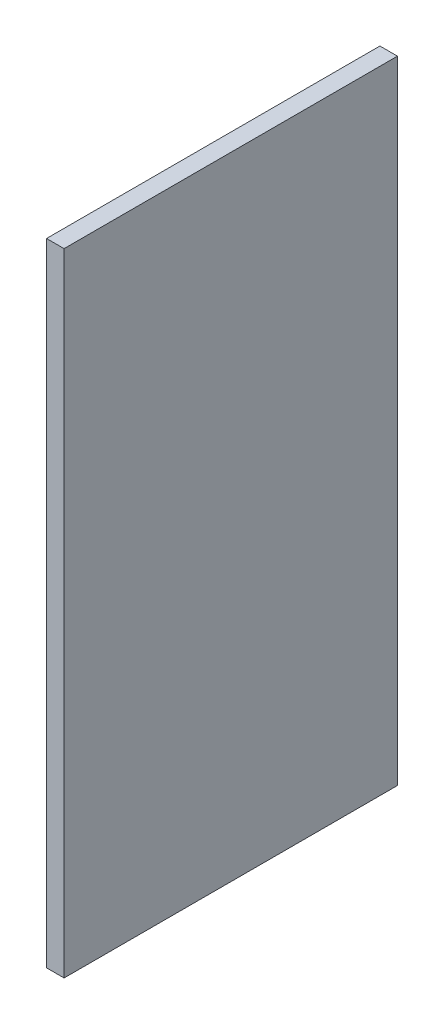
ISO-10303-21;
HEADER;
FILE_DESCRIPTION(('STEP AP214'),'2;1');
FILE_NAME('part.step','',(''),(''),'','','');
FILE_SCHEMA(('AUTOMOTIVE_DESIGN { 1 0 10303 214 1 1 1 1 }'));
ENDSEC;
DATA;
#1=APPLICATION_CONTEXT('core data for automotive mechanical design processes');
#2=APPLICATION_PROTOCOL_DEFINITION('international standard','automotive_design',2000,#1);
#3=PRODUCT_CONTEXT('',#1,'mechanical');
#4=PRODUCT('Part','Part','',(#3));
#5=PRODUCT_RELATED_PRODUCT_CATEGORY('part','',(#4));
#6=PRODUCT_DEFINITION_FORMATION('','',#4);
#7=PRODUCT_DEFINITION_CONTEXT('part definition',#1,'design');
#8=PRODUCT_DEFINITION('design','',#6,#7);
#9=PRODUCT_DEFINITION_SHAPE('','',#8);
#10=(LENGTH_UNIT() NAMED_UNIT(*) SI_UNIT(.MILLI.,.METRE.));
#11=(NAMED_UNIT(*) PLANE_ANGLE_UNIT() SI_UNIT($,.RADIAN.));
#12=(NAMED_UNIT(*) SI_UNIT($,.STERADIAN.) SOLID_ANGLE_UNIT());
#13=UNCERTAINTY_MEASURE_WITH_UNIT(LENGTH_MEASURE(1.E-05),#10,'distance_accuracy_value','');
#14=(GEOMETRIC_REPRESENTATION_CONTEXT(3) GLOBAL_UNCERTAINTY_ASSIGNED_CONTEXT((#13)) GLOBAL_UNIT_ASSIGNED_CONTEXT((#10,
#11,#12)) REPRESENTATION_CONTEXT('',''));
#15=CARTESIAN_POINT('',(0.,0.,0.));
#16=DIRECTION('',(0.,0.,1.));
#17=DIRECTION('',(1.,0.,0.));
#18=AXIS2_PLACEMENT_3D('',#15,#16,#17);
#19=CARTESIAN_POINT('',(25.4,0.,0.));
#20=DIRECTION('',(0.,1.,0.));
#21=DIRECTION('',(0.,0.,1.));
#22=AXIS2_PLACEMENT_3D('',#19,#20,#21);
#23=PLANE('',#22);
#24=DIRECTION('',(0.,0.,-1.));
#25=VECTOR('',#24,1.);
#26=CARTESIAN_POINT('',(0.,0.,0.));
#27=LINE('',#26,#25);
#28=CARTESIAN_POINT('',(0.,-1.11022302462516E-13,482.6));
#29=VERTEX_POINT('',#28);
#30=CARTESIAN_POINT('',(0.,0.,0.));
#31=VERTEX_POINT('',#30);
#32=EDGE_CURVE('E113',#29,#31,#27,.T.);
#33=ORIENTED_EDGE('',*,*,#32,.T.);
#34=DIRECTION('',(-1.,0.,0.));
#35=VECTOR('',#34,1.);
#36=CARTESIAN_POINT('',(25.4,0.,0.));
#37=LINE('',#36,#35);
#38=CARTESIAN_POINT('',(25.4,0.,0.));
#39=VERTEX_POINT('',#38);
#40=EDGE_CURVE('E11',#39,#31,#37,.T.);
#41=ORIENTED_EDGE('',*,*,#40,.F.);
#42=DIRECTION('',(0.,0.,-1.));
#43=VECTOR('',#42,1.);
#44=CARTESIAN_POINT('',(25.4,0.,0.));
#45=LINE('',#44,#43);
#46=CARTESIAN_POINT('',(25.4,-1.11022302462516E-13,482.6));
#47=VERTEX_POINT('',#46);
#48=EDGE_CURVE('E97',#47,#39,#45,.T.);
#49=ORIENTED_EDGE('',*,*,#48,.F.);
#50=DIRECTION('',(-1.,0.,0.));
#51=VECTOR('',#50,1.);
#52=CARTESIAN_POINT('',(25.4,-1.11022302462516E-13,482.6));
#53=LINE('',#52,#51);
#54=EDGE_CURVE('E109',#47,#29,#53,.T.);
#55=ORIENTED_EDGE('',*,*,#54,.T.);
#56=EDGE_LOOP('',(#33,#41,#49,#55));
#57=FACE_BOUND('',#56,.T.);
#58=ADVANCED_FACE('F45',(#57),#23,.F.);
#59=CARTESIAN_POINT('',(25.4,0.,0.));
#60=DIRECTION('',(0.,0.,1.));
#61=DIRECTION('',(1.,0.,0.));
#62=AXIS2_PLACEMENT_3D('',#59,#60,#61);
#63=PLANE('',#62);
#64=DIRECTION('',(0.,1.,0.));
#65=VECTOR('',#64,1.);
#66=CARTESIAN_POINT('',(0.,0.,0.));
#67=LINE('',#66,#65);
#68=CARTESIAN_POINT('',(0.,914.4,0.));
#69=VERTEX_POINT('',#68);
#70=EDGE_CURVE('E102',#31,#69,#67,.T.);
#71=ORIENTED_EDGE('',*,*,#70,.T.);
#72=DIRECTION('',(-1.,0.,0.));
#73=VECTOR('',#72,1.);
#74=CARTESIAN_POINT('',(25.4,914.4,0.));
#75=LINE('',#74,#73);
#76=CARTESIAN_POINT('',(25.4,914.4,0.));
#77=VERTEX_POINT('',#76);
#78=EDGE_CURVE('E54',#77,#69,#75,.T.);
#79=ORIENTED_EDGE('',*,*,#78,.F.);
#80=DIRECTION('',(0.,1.,0.));
#81=VECTOR('',#80,1.);
#82=CARTESIAN_POINT('',(25.4,0.,0.));
#83=LINE('',#82,#81);
#84=EDGE_CURVE('E92',#39,#77,#83,.T.);
#85=ORIENTED_EDGE('',*,*,#84,.F.);
#86=ORIENTED_EDGE('',*,*,#40,.T.);
#87=EDGE_LOOP('',(#71,#79,#85,#86));
#88=FACE_BOUND('',#87,.T.);
#89=ADVANCED_FACE('F101',(#88),#63,.F.);
#90=CARTESIAN_POINT('',(25.4,914.4,0.));
#91=DIRECTION('',(0.,-1.,0.));
#92=DIRECTION('',(0.,0.,-1.));
#93=AXIS2_PLACEMENT_3D('',#90,#91,#92);
#94=PLANE('',#93);
#95=DIRECTION('',(0.,0.,1.));
#96=VECTOR('',#95,1.);
#97=CARTESIAN_POINT('',(0.,914.4,0.));
#98=LINE('',#97,#96);
#99=CARTESIAN_POINT('',(0.,914.4,482.6));
#100=VERTEX_POINT('',#99);
#101=EDGE_CURVE('E79',#69,#100,#98,.T.);
#102=ORIENTED_EDGE('',*,*,#101,.T.);
#103=DIRECTION('',(-1.,0.,0.));
#104=VECTOR('',#103,1.);
#105=CARTESIAN_POINT('',(25.4,914.4,482.6));
#106=LINE('',#105,#104);
#107=CARTESIAN_POINT('',(25.4,914.4,482.6));
#108=VERTEX_POINT('',#107);
#109=EDGE_CURVE('E104',#108,#100,#106,.T.);
#110=ORIENTED_EDGE('',*,*,#109,.F.);
#111=DIRECTION('',(0.,0.,1.));
#112=VECTOR('',#111,1.);
#113=CARTESIAN_POINT('',(25.4,914.4,0.));
#114=LINE('',#113,#112);
#115=EDGE_CURVE('E95',#77,#108,#114,.T.);
#116=ORIENTED_EDGE('',*,*,#115,.F.);
#117=ORIENTED_EDGE('',*,*,#78,.T.);
#118=EDGE_LOOP('',(#102,#110,#116,#117));
#119=FACE_BOUND('',#118,.T.);
#120=ADVANCED_FACE('F105',(#119),#94,.F.);
#121=CARTESIAN_POINT('',(25.4,-1.11022302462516E-13,482.6));
#122=DIRECTION('',(0.,0.,-1.));
#123=DIRECTION('',(-1.,0.,0.));
#124=AXIS2_PLACEMENT_3D('',#121,#122,#123);
#125=PLANE('',#124);
#126=DIRECTION('',(0.,-1.,0.));
#127=VECTOR('',#126,1.);
#128=CARTESIAN_POINT('',(0.,-1.11022302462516E-13,482.6));
#129=LINE('',#128,#127);
#130=EDGE_CURVE('E85',#100,#29,#129,.T.);
#131=ORIENTED_EDGE('',*,*,#130,.T.);
#132=ORIENTED_EDGE('',*,*,#54,.F.);
#133=DIRECTION('',(0.,-1.,0.));
#134=VECTOR('',#133,1.);
#135=CARTESIAN_POINT('',(25.4,-1.11022302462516E-13,482.6));
#136=LINE('',#135,#134);
#137=EDGE_CURVE('E62',#108,#47,#136,.T.);
#138=ORIENTED_EDGE('',*,*,#137,.F.);
#139=ORIENTED_EDGE('',*,*,#109,.T.);
#140=EDGE_LOOP('',(#131,#132,#138,#139));
#141=FACE_BOUND('',#140,.T.);
#142=ADVANCED_FACE('F126',(#141),#125,.F.);
#143=CARTESIAN_POINT('',(25.4,0.,0.));
#144=DIRECTION('',(-1.,0.,0.));
#145=DIRECTION('',(0.,0.,1.));
#146=AXIS2_PLACEMENT_3D('',#143,#144,#145);
#147=PLANE('',#146);
#148=ORIENTED_EDGE('',*,*,#48,.T.);
#149=ORIENTED_EDGE('',*,*,#84,.T.);
#150=ORIENTED_EDGE('',*,*,#115,.T.);
#151=ORIENTED_EDGE('',*,*,#137,.T.);
#152=EDGE_LOOP('',(#148,#149,#150,#151));
#153=FACE_BOUND('',#152,.T.);
#154=ADVANCED_FACE('F93',(#153),#147,.F.);
#155=CARTESIAN_POINT('',(0.,0.,0.));
#156=DIRECTION('',(-1.,0.,0.));
#157=DIRECTION('',(0.,0.,1.));
#158=AXIS2_PLACEMENT_3D('',#155,#156,#157);
#159=PLANE('',#158);
#160=ORIENTED_EDGE('',*,*,#32,.F.);
#161=ORIENTED_EDGE('',*,*,#130,.F.);
#162=ORIENTED_EDGE('',*,*,#101,.F.);
#163=ORIENTED_EDGE('',*,*,#70,.F.);
#164=EDGE_LOOP('',(#160,#161,#162,#163));
#165=FACE_BOUND('',#164,.T.);
#166=ADVANCED_FACE('F129',(#165),#159,.T.);
#167=CLOSED_SHELL('',(#58,#89,#120,#142,#154,#166));
#168=MANIFOLD_SOLID_BREP('B2',#167);
#169=ADVANCED_BREP_SHAPE_REPRESENTATION('',(#18,#168),#14);
#170=SHAPE_DEFINITION_REPRESENTATION(#9,#169);
ENDSEC;
END-ISO-10303-21;
